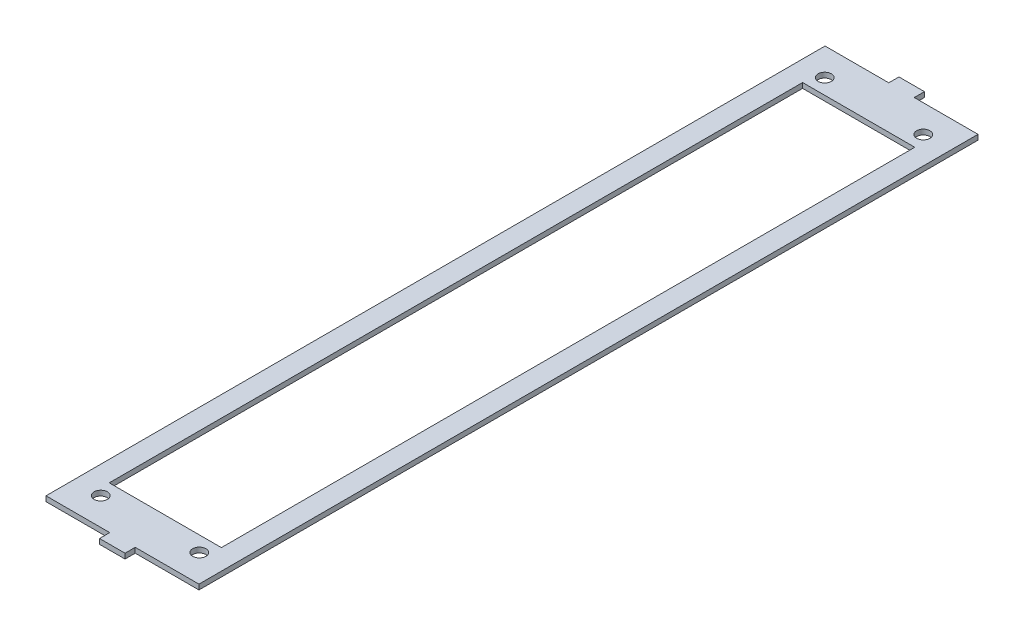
from build123d import *

# Parameters (mm, degrees)
CROQUIS1_R              = 3.9
CROQUIS1_W              = 66
CROQUIS1_H              = 408
SALIENTE_EXTRUIR1_DEPTH = 3


with BuildPart() as part:
    # Croquis1 → Saliente-Extruir1 (new body)
    with BuildSketch(Plane(origin=(0, 0, 0), x_dir=(1, 0, 0), z_dir=(0, 1, 0))):
        Polygon((-12, -433.2), (25.5, -433.2), (25.5, -439.2), (40.5, -439.2), (40.5, -433.2), (78, -433.2), (78, 25.2), (40.5, 25.2), (40.5, 31.2), (25.5, 31.2), (25.5, 25.2), (-12, 25.2), align=None)
        with Locations(Location((4, 9, 0), (0, 0, 270))):
            Circle(CROQUIS1_R, mode=Mode.SUBTRACT)
        with Locations(Location((62, 9, 0), (0, 0, 90))):
            Circle(CROQUIS1_R, mode=Mode.SUBTRACT)
        with Locations(Location((62, -417, 0), (0, 0, 270))):
            Circle(CROQUIS1_R, mode=Mode.SUBTRACT)
        with Locations(Location((4, -417, 0), (0, 0, 90))):
            Circle(CROQUIS1_R, mode=Mode.SUBTRACT)
        with Locations((33, -204)):
            Rectangle(CROQUIS1_W, CROQUIS1_H, mode=Mode.SUBTRACT)
    extrude(amount=SALIENTE_EXTRUIR1_DEPTH)


solid = part.part
